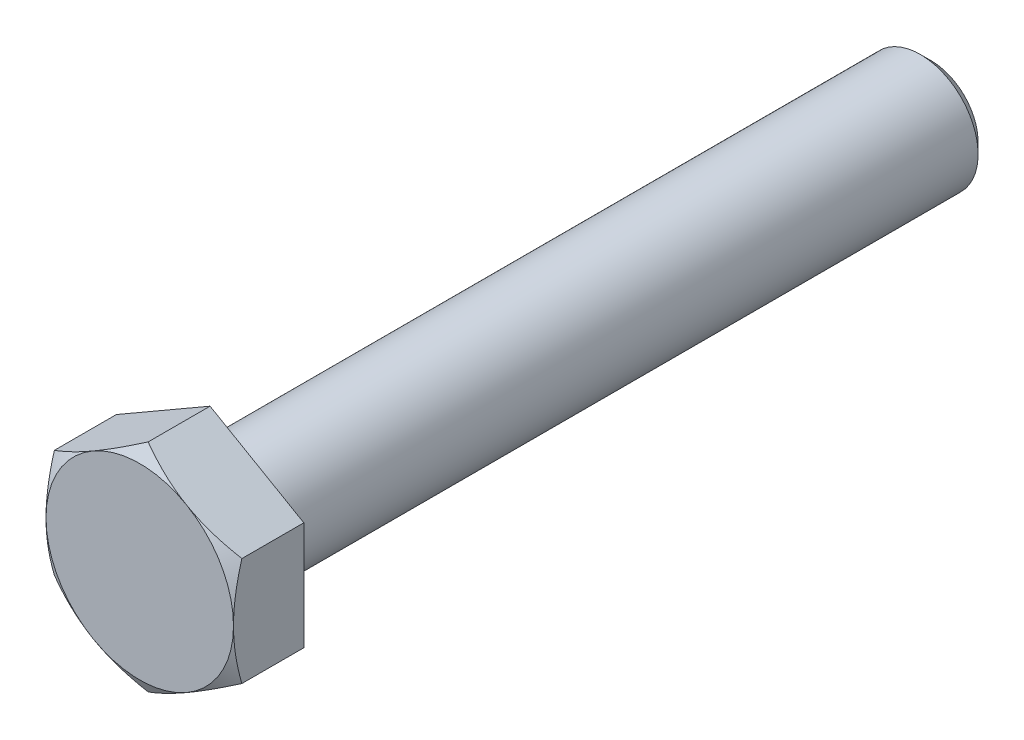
ISO-10303-21;
HEADER;
FILE_DESCRIPTION(('STEP AP214'),'2;1');
FILE_NAME('part.step','',(''),(''),'','','');
FILE_SCHEMA(('AUTOMOTIVE_DESIGN { 1 0 10303 214 1 1 1 1 }'));
ENDSEC;
DATA;
#1=APPLICATION_CONTEXT('core data for automotive mechanical design processes');
#2=APPLICATION_PROTOCOL_DEFINITION('international standard','automotive_design',2000,#1);
#3=PRODUCT_CONTEXT('',#1,'mechanical');
#4=PRODUCT('Part','Part','',(#3));
#5=PRODUCT_RELATED_PRODUCT_CATEGORY('part','',(#4));
#6=PRODUCT_DEFINITION_FORMATION('','',#4);
#7=PRODUCT_DEFINITION_CONTEXT('part definition',#1,'design');
#8=PRODUCT_DEFINITION('design','',#6,#7);
#9=PRODUCT_DEFINITION_SHAPE('','',#8);
#10=(LENGTH_UNIT() NAMED_UNIT(*) SI_UNIT(.MILLI.,.METRE.));
#11=(NAMED_UNIT(*) PLANE_ANGLE_UNIT() SI_UNIT($,.RADIAN.));
#12=(NAMED_UNIT(*) SI_UNIT($,.STERADIAN.) SOLID_ANGLE_UNIT());
#13=UNCERTAINTY_MEASURE_WITH_UNIT(LENGTH_MEASURE(1.E-05),#10,'distance_accuracy_value','');
#14=(GEOMETRIC_REPRESENTATION_CONTEXT(3) GLOBAL_UNCERTAINTY_ASSIGNED_CONTEXT((#13)) GLOBAL_UNIT_ASSIGNED_CONTEXT((#10,
#11,#12)) REPRESENTATION_CONTEXT('',''));
#15=CARTESIAN_POINT('',(0.,0.,0.));
#16=DIRECTION('',(0.,0.,1.));
#17=DIRECTION('',(1.,0.,0.));
#18=AXIS2_PLACEMENT_3D('',#15,#16,#17);
#19=CARTESIAN_POINT('',(0.,-23.8301323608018,8.5873335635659));
#20=DIRECTION('',(0.5,-0.866025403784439,0.));
#21=DIRECTION('',(0.866025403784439,0.5,0.));
#22=AXIS2_PLACEMENT_3D('',#19,#20,#21);
#23=PLANE('',#22);
#24=DIRECTION('',(0.,0.,1.));
#25=VECTOR('',#24,1.);
#26=CARTESIAN_POINT('',(20.6375,-11.9150661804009,8.5873335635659));
#27=LINE('',#26,#25);
#28=CARTESIAN_POINT('',(20.6375,-11.9150661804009,71.6359375));
#29=VERTEX_POINT('',#28);
#30=CARTESIAN_POINT('',(20.6375,-11.9150661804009,85.2707953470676));
#31=VERTEX_POINT('',#30);
#32=EDGE_CURVE('E159',#29,#31,#27,.T.);
#33=ORIENTED_EDGE('',*,*,#32,.T.);
#34=CARTESIAN_POINT('',(20.6377,-11.9149507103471,85.2707286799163));
#35=CARTESIAN_POINT('',(20.1840964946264,-12.1768388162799,85.4219191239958));
#36=CARTESIAN_POINT('',(19.7287236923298,-12.4397484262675,85.5662487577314));
#37=CARTESIAN_POINT('',(18.814326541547,-12.9676758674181,85.8392793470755));
#38=CARTESIAN_POINT('',(18.3553010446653,-13.2326943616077,85.9679751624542));
#39=CARTESIAN_POINT('',(17.4327113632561,-13.7653517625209,86.2080081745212));
#40=CARTESIAN_POINT('',(16.9691391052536,-14.0329953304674,86.3193042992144));
#41=CARTESIAN_POINT('',(16.0387734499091,-14.5701421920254,86.5221480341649));
#42=CARTESIAN_POINT('',(15.571980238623,-14.8396453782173,86.613696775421));
#43=CARTESIAN_POINT('',(14.6471334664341,-15.3736059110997,86.7731519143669));
#44=CARTESIAN_POINT('',(14.1891485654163,-15.6380236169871,86.8415860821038));
#45=CARTESIAN_POINT('',(13.27108023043,-16.1680706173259,86.9563346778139));
#46=CARTESIAN_POINT('',(12.8109967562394,-16.4336999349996,87.0026486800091));
#47=CARTESIAN_POINT('',(11.890056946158,-16.9654047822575,87.0719875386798));
#48=CARTESIAN_POINT('',(11.4292021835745,-17.2314794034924,87.0950400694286));
#49=CARTESIAN_POINT('',(10.5070673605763,-17.7638741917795,87.1173602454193));
#50=CARTESIAN_POINT('',(10.045787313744,-18.03019435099,87.1166286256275));
#51=CARTESIAN_POINT('',(9.18341530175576,-18.528085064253,87.0930416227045));
#52=CARTESIAN_POINT('',(8.78226192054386,-18.759691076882,87.0730624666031));
#53=CARTESIAN_POINT('',(7.98091285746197,-19.2223501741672,87.0154953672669));
#54=CARTESIAN_POINT('',(7.58071716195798,-19.453403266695,86.9779076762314));
#55=CARTESIAN_POINT('',(6.78143133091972,-19.9148711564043,86.8857749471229));
#56=CARTESIAN_POINT('',(6.38234252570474,-20.1452851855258,86.8312145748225));
#57=CARTESIAN_POINT('',(5.5860758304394,-20.605009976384,86.7061021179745));
#58=CARTESIAN_POINT('',(5.18889793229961,-20.8343207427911,86.6355501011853));
#59=CARTESIAN_POINT('',(3.98315033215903,-21.530459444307,86.3980959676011));
#60=CARTESIAN_POINT('',(3.17800639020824,-21.9953095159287,86.2075040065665));
#61=CARTESIAN_POINT('',(1.97918213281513,-22.6874510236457,85.8830300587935));
#62=CARTESIAN_POINT('',(1.58139951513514,-22.9171109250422,85.7685578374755));
#63=CARTESIAN_POINT('',(0.788585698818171,-23.37484219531,85.5280244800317));
#64=CARTESIAN_POINT('',(0.393553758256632,-23.6029139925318,85.4019666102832));
#65=CARTESIAN_POINT('',(-0.000199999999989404,-23.8302478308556,85.2707286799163));
#66=B_SPLINE_CURVE_WITH_KNOTS('',3,(#34,#35,#36,#37,#38,#39,#40,#41,#42,#43,#44,#45,#46,#47,#48,
#49,#50,#51,#52,#53,#54,#55,#56,#57,#58,#59,#60,#61,#62,#63,#64,#65),.UNSPECIFIED.,.F.,.F.,(4,2,
2,2,2,2,2,2,2,2,2,2,2,2,2,4),(0.,1.63552456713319,3.2715854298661,4.91145173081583,
6.55122408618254,8.1505234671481,9.74985363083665,11.3472788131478,12.9446546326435,
14.3352468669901,15.7258191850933,17.1176515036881,18.5094779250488,21.3544387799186,
22.7744411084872,24.1940443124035),.UNSPECIFIED.);
#67=CARTESIAN_POINT('',(10.31875,-17.8725992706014,87.1140625));
#68=VERTEX_POINT('',#67);
#69=EDGE_CURVE('E278',#31,#68,#66,.T.);
#70=ORIENTED_EDGE('',*,*,#69,.T.);
#71=CARTESIAN_POINT('',(0.,-23.8301323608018,85.2707953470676));
#72=VERTEX_POINT('',#71);
#73=EDGE_CURVE('E202',#68,#72,#66,.T.);
#74=ORIENTED_EDGE('',*,*,#73,.T.);
#75=DIRECTION('',(0.,0.,1.));
#76=VECTOR('',#75,1.);
#77=CARTESIAN_POINT('',(0.,-23.8301323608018,8.5873335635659));
#78=LINE('',#77,#76);
#79=CARTESIAN_POINT('',(0.,-23.8301323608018,71.6359375));
#80=VERTEX_POINT('',#79);
#81=EDGE_CURVE('E302',#80,#72,#78,.T.);
#82=ORIENTED_EDGE('',*,*,#81,.F.);
#83=DIRECTION('',(0.866025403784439,0.5,0.));
#84=VECTOR('',#83,1.);
#85=CARTESIAN_POINT('',(0.,-23.8301323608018,71.6359375));
#86=LINE('',#85,#84);
#87=EDGE_CURVE('E157',#80,#29,#86,.T.);
#88=ORIENTED_EDGE('',*,*,#87,.T.);
#89=EDGE_LOOP('',(#33,#70,#74,#82,#88));
#90=FACE_BOUND('',#89,.T.);
#91=ADVANCED_FACE('F46',(#90),#23,.T.);
#92=CARTESIAN_POINT('',(20.6375,-11.9150661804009,8.5873335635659));
#93=DIRECTION('',(1.,0.,0.));
#94=DIRECTION('',(0.,0.,-1.));
#95=AXIS2_PLACEMENT_3D('',#92,#93,#94);
#96=PLANE('',#95);
#97=DIRECTION('',(0.,0.,1.));
#98=VECTOR('',#97,1.);
#99=CARTESIAN_POINT('',(20.6375,11.9150661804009,8.5873335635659));
#100=LINE('',#99,#98);
#101=CARTESIAN_POINT('',(20.6375,11.9150661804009,71.6359375));
#102=VERTEX_POINT('',#101);
#103=CARTESIAN_POINT('',(20.6375,11.9150661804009,85.2707953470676));
#104=VERTEX_POINT('',#103);
#105=EDGE_CURVE('E316',#102,#104,#100,.T.);
#106=ORIENTED_EDGE('',*,*,#105,.T.);
#107=CARTESIAN_POINT('',(20.6375,-32.4256154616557,76.838087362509));
#108=CARTESIAN_POINT('',(20.6375,-31.9730806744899,77.0584981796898));
#109=CARTESIAN_POINT('',(20.6375,-31.5200260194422,77.2778411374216));
#110=CARTESIAN_POINT('',(20.6375,-30.612768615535,77.7141502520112));
#111=CARTESIAN_POINT('',(20.6375,-30.1585658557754,77.9311163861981));
#112=CARTESIAN_POINT('',(20.6375,-28.7939575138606,78.5781424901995));
#113=CARTESIAN_POINT('',(20.6375,-27.8816794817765,79.0042678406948));
#114=CARTESIAN_POINT('',(20.6375,-26.0463911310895,79.845731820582));
#115=CARTESIAN_POINT('',(20.6375,-25.123349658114,80.2610026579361));
#116=CARTESIAN_POINT('',(20.6375,-23.2700704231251,81.0751054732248));
#117=CARTESIAN_POINT('',(20.6375,-22.3398329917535,81.4739382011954));
#118=CARTESIAN_POINT('',(20.6375,-20.439323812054,82.2638617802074));
#119=CARTESIAN_POINT('',(20.6375,-19.4687560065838,82.6542439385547));
#120=CARTESIAN_POINT('',(20.6375,-17.5164156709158,83.4064689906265));
#121=CARTESIAN_POINT('',(20.6375,-16.5346419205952,83.7683087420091));
#122=CARTESIAN_POINT('',(20.6375,-14.5600631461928,84.454252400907));
#123=CARTESIAN_POINT('',(20.6375,-13.5672836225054,84.7784291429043));
#124=CARTESIAN_POINT('',(20.6375,-11.5673985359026,85.3789448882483));
#125=CARTESIAN_POINT('',(20.6375,-10.560297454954,85.6552985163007));
#126=CARTESIAN_POINT('',(20.6375,-9.04144034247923,86.0234282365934));
#127=CARTESIAN_POINT('',(20.6375,-8.53521428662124,86.1381479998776));
#128=CARTESIAN_POINT('',(20.6375,-7.51922760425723,86.3507870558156));
#129=CARTESIAN_POINT('',(20.6375,-7.00946704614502,86.4487066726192));
#130=CARTESIAN_POINT('',(20.6375,-5.98674447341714,86.6260418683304));
#131=CARTESIAN_POINT('',(20.6375,-5.47378260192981,86.7054582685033));
#132=CARTESIAN_POINT('',(20.6375,-4.44513343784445,86.8442256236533));
#133=CARTESIAN_POINT('',(20.6375,-3.92944614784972,86.9035765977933));
#134=CARTESIAN_POINT('',(20.6375,-2.90301545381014,87.0002601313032));
#135=CARTESIAN_POINT('',(20.6375,-2.39229917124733,87.0378788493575));
#136=CARTESIAN_POINT('',(20.6375,-1.36973286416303,87.091466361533));
#137=CARTESIAN_POINT('',(20.6375,-0.857882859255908,87.1074355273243));
#138=CARTESIAN_POINT('',(20.6375,0.166038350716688,87.1173420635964));
#139=CARTESIAN_POINT('',(20.6375,0.678109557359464,87.1112792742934));
#140=CARTESIAN_POINT('',(20.6375,1.70153150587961,87.0772740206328));
#141=CARTESIAN_POINT('',(20.6375,2.21288221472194,87.0493305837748));
#142=CARTESIAN_POINT('',(20.6375,3.42907871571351,86.9574526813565));
#143=CARTESIAN_POINT('',(20.6375,4.13320752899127,86.8838462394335));
#144=CARTESIAN_POINT('',(20.6375,5.53651886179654,86.6990545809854));
#145=CARTESIAN_POINT('',(20.6375,6.23570074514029,86.5878646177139));
#146=CARTESIAN_POINT('',(20.6375,7.6283451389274,86.331860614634));
#147=CARTESIAN_POINT('',(20.6375,8.32180314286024,86.1870222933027));
#148=CARTESIAN_POINT('',(20.6375,9.70190431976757,85.8681605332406));
#149=CARTESIAN_POINT('',(20.6375,10.3885475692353,85.6941374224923));
#150=CARTESIAN_POINT('',(20.6375,11.7709004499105,85.3168368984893));
#151=CARTESIAN_POINT('',(20.6375,12.4664487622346,85.1129725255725));
#152=CARTESIAN_POINT('',(20.6375,13.8506972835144,84.6833091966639));
#153=CARTESIAN_POINT('',(20.6375,14.5393974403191,84.4575100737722));
#154=CARTESIAN_POINT('',(20.6375,15.9102893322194,83.9876361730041));
#155=CARTESIAN_POINT('',(20.6375,16.5924828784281,83.7435666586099));
#156=CARTESIAN_POINT('',(20.6375,17.611479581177,83.3659775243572));
#157=CARTESIAN_POINT('',(20.6375,17.9504279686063,83.2382009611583));
#158=CARTESIAN_POINT('',(20.6375,18.6269817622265,82.9791365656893));
#159=CARTESIAN_POINT('',(20.6375,18.9645871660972,82.8478487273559));
#160=CARTESIAN_POINT('',(20.6375,19.8670735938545,82.4919349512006));
#161=CARTESIAN_POINT('',(20.6375,20.4308061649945,82.2643948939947));
#162=CARTESIAN_POINT('',(20.6375,21.5550661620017,81.8015147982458));
#163=CARTESIAN_POINT('',(20.6375,22.1155935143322,81.5661745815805));
#164=CARTESIAN_POINT('',(20.6375,23.233806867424,81.0887225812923));
#165=CARTESIAN_POINT('',(20.6375,23.7914926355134,80.8466102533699));
#166=CARTESIAN_POINT('',(20.6375,24.9042782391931,80.3565084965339));
#167=CARTESIAN_POINT('',(20.6375,25.4593780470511,80.1085190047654));
#168=CARTESIAN_POINT('',(20.6375,27.1216033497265,79.3567109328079));
#169=CARTESIAN_POINT('',(20.6375,28.2252618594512,78.8452217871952));
#170=CARTESIAN_POINT('',(20.6375,30.4250858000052,77.8065590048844));
#171=CARTESIAN_POINT('',(20.6375,31.5212515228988,77.2793859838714));
#172=CARTESIAN_POINT('',(20.6375,33.709278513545,76.2118893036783));
#173=CARTESIAN_POINT('',(20.6375,34.801130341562,75.6715463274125));
#174=CARTESIAN_POINT('',(20.6375,36.9799230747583,74.5810445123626));
#175=CARTESIAN_POINT('',(20.6375,38.0668639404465,74.0308855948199));
#176=CARTESIAN_POINT('',(20.6375,40.2364746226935,72.9227781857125));
#177=CARTESIAN_POINT('',(20.6375,41.3191452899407,72.3648313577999));
#178=CARTESIAN_POINT('',(20.6375,43.4811328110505,71.242491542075));
#179=CARTESIAN_POINT('',(20.6375,44.5604496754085,70.6780985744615));
#180=CARTESIAN_POINT('',(20.6375,46.6038665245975,69.6031275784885));
#181=CARTESIAN_POINT('',(20.6375,47.5682435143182,69.0930756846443));
#182=CARTESIAN_POINT('',(20.6375,49.4950666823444,68.0693366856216));
#183=CARTESIAN_POINT('',(20.6375,50.4575128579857,67.5556495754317));
#184=CARTESIAN_POINT('',(20.6375,53.3424750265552,66.009887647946));
#185=CARTESIAN_POINT('',(20.6375,55.2625043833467,64.9731704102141));
#186=CARTESIAN_POINT('',(20.6375,58.1356204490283,63.4128746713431));
#187=CARTESIAN_POINT('',(20.6375,59.0905984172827,62.8927700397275));
#188=CARTESIAN_POINT('',(20.6375,60.9994506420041,61.8505377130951));
#189=CARTESIAN_POINT('',(20.6375,61.9533248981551,61.3284100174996));
#190=CARTESIAN_POINT('',(20.6375,63.8600285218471,60.2824241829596));
#191=CARTESIAN_POINT('',(20.6375,64.8128579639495,59.7585661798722));
#192=CARTESIAN_POINT('',(20.6375,66.7176507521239,58.7092806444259));
#193=CARTESIAN_POINT('',(20.6375,67.6696140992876,58.1838531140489));
#194=CARTESIAN_POINT('',(20.6375,68.6211983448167,57.6577405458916));
#195=B_SPLINE_CURVE_WITH_KNOTS('',3,(#107,#108,#109,#110,#111,#112,#113,#114,#115,#116,#117,
#118,#119,#120,#121,#122,#123,#124,#125,#126,#127,#128,#129,#130,#131,#132,#133,#134,#135,#136,
#137,#138,#139,#140,#141,#142,#143,#144,#145,#146,#147,#148,#149,#150,#151,#152,#153,#154,#155,
#156,#157,#158,#159,#160,#161,#162,#163,#164,#165,#166,#167,#168,#169,#170,#171,#172,#173,#174,
#175,#176,#177,#178,#179,#180,#181,#182,#183,#184,#185,#186,#187,#188,#189,#190,#191,#192,#193,
#194),.UNSPECIFIED.,.F.,.F.,(4,2,2,2,2,2,2,2,2,2,2,2,2,2,2,2,2,2,2,2,2,2,2,2,2,2,2,2,2,2,2,2,2,
2,2,2,2,2,2,2,2,2,2,4),(0.,1.51006956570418,3.02015352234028,6.0407474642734,9.07708394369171,
12.1132817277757,15.2513462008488,18.3897556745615,21.5219911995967,24.6532671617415,
26.2102197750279,27.7671423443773,29.3239957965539,30.8808477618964,32.4167030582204,
33.9525319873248,35.4883720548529,37.024280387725,39.1470128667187,41.2700135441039,
43.3945510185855,45.5190646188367,47.6930602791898,49.867072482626,52.0404607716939,
53.1271447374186,54.2138305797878,56.0375227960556,57.8612566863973,59.6851375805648,
61.5090379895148,65.1581216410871,68.807062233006,72.4617221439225,76.116411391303,
79.7703315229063,83.4242402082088,86.6970868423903,89.9699379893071,96.5160143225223,
99.778286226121,103.040559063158,106.302581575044,109.564599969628),.UNSPECIFIED.);
#196=CARTESIAN_POINT('',(20.6375,0.,87.1140625));
#197=VERTEX_POINT('',#196);
#198=EDGE_CURVE('E121',#104,#197,#195,.F.);
#199=ORIENTED_EDGE('',*,*,#198,.T.);
#200=EDGE_CURVE('E166',#197,#31,#195,.F.);
#201=ORIENTED_EDGE('',*,*,#200,.T.);
#202=ORIENTED_EDGE('',*,*,#32,.F.);
#203=DIRECTION('',(0.,1.,0.));
#204=VECTOR('',#203,1.);
#205=CARTESIAN_POINT('',(20.6375,-11.9150661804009,71.6359375));
#206=LINE('',#205,#204);
#207=EDGE_CURVE('E308',#29,#102,#206,.T.);
#208=ORIENTED_EDGE('',*,*,#207,.T.);
#209=EDGE_LOOP('',(#106,#199,#201,#202,#208));
#210=FACE_BOUND('',#209,.T.);
#211=ADVANCED_FACE('F232',(#210),#96,.T.);
#212=CARTESIAN_POINT('',(20.6375,11.9150661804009,8.5873335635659));
#213=DIRECTION('',(0.5,0.866025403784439,0.));
#214=DIRECTION('',(-0.866025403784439,0.5,0.));
#215=AXIS2_PLACEMENT_3D('',#212,#213,#214);
#216=PLANE('',#215);
#217=DIRECTION('',(0.,0.,1.));
#218=VECTOR('',#217,1.);
#219=CARTESIAN_POINT('',(0.,23.8301323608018,8.5873335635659));
#220=LINE('',#219,#218);
#221=CARTESIAN_POINT('',(0.,23.8301323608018,71.6359375));
#222=VERTEX_POINT('',#221);
#223=CARTESIAN_POINT('',(0.,23.8301323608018,85.2707953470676));
#224=VERTEX_POINT('',#223);
#225=EDGE_CURVE('E153',#222,#224,#220,.T.);
#226=ORIENTED_EDGE('',*,*,#225,.T.);
#227=CARTESIAN_POINT('',(-0.000199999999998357,23.8302478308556,85.2707286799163));
#228=CARTESIAN_POINT('',(0.453403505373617,23.5683597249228,85.4219191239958));
#229=CARTESIAN_POINT('',(0.908776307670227,23.3054501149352,85.5662487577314));
#230=CARTESIAN_POINT('',(1.82317345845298,22.7775226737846,85.8392793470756));
#231=CARTESIAN_POINT('',(2.28219895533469,22.512504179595,85.9679751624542));
#232=CARTESIAN_POINT('',(3.20478863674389,21.9798467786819,86.2080081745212));
#233=CARTESIAN_POINT('',(3.66836089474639,21.7122032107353,86.3193042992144));
#234=CARTESIAN_POINT('',(4.59872655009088,21.1750563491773,86.5221480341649));
#235=CARTESIAN_POINT('',(5.06551976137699,20.9055531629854,86.613696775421));
#236=CARTESIAN_POINT('',(5.99036653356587,20.371592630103,86.7731519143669));
#237=CARTESIAN_POINT('',(6.44835143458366,20.1071749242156,86.8415860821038));
#238=CARTESIAN_POINT('',(7.36641976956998,19.5771279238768,86.9563346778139));
#239=CARTESIAN_POINT('',(7.82650324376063,19.3114986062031,87.0026486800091));
#240=CARTESIAN_POINT('',(8.74744305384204,18.7797937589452,87.0719875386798));
#241=CARTESIAN_POINT('',(9.20829781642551,18.5137191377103,87.0950400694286));
#242=CARTESIAN_POINT('',(10.1304326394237,17.9813243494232,87.1173602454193));
#243=CARTESIAN_POINT('',(10.591712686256,17.7150041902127,87.1166286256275));
#244=CARTESIAN_POINT('',(11.4540846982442,17.2171134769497,87.0930416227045));
#245=CARTESIAN_POINT('',(11.8552380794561,16.9855074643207,87.0730624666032));
#246=CARTESIAN_POINT('',(12.656587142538,16.5228483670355,87.0154953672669));
#247=CARTESIAN_POINT('',(13.056782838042,16.2917952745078,86.9779076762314));
#248=CARTESIAN_POINT('',(13.8560686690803,15.8303273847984,86.8857749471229));
#249=CARTESIAN_POINT('',(14.2551574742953,15.5999133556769,86.8312145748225));
#250=CARTESIAN_POINT('',(15.0514241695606,15.1401885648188,86.7061021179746));
#251=CARTESIAN_POINT('',(15.4486020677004,14.9108777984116,86.6355501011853));
#252=CARTESIAN_POINT('',(16.654349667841,14.2147390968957,86.3980959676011));
#253=CARTESIAN_POINT('',(17.4594936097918,13.749889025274,86.2075040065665));
#254=CARTESIAN_POINT('',(18.6583178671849,13.057747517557,85.8830300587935));
#255=CARTESIAN_POINT('',(19.0561004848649,12.8280876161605,85.7685578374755));
#256=CARTESIAN_POINT('',(19.8489143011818,12.3703563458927,85.5280244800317));
#257=CARTESIAN_POINT('',(20.2439462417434,12.1422845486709,85.4019666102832));
#258=CARTESIAN_POINT('',(20.6377,11.9149507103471,85.2707286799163));
#259=B_SPLINE_CURVE_WITH_KNOTS('',3,(#227,#228,#229,#230,#231,#232,#233,#234,#235,#236,#237,
#238,#239,#240,#241,#242,#243,#244,#245,#246,#247,#248,#249,#250,#251,#252,#253,#254,#255,#256,
#257,#258),.UNSPECIFIED.,.F.,.F.,(4,2,2,2,2,2,2,2,2,2,2,2,2,2,2,4),(0.,1.63552456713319,
3.27158542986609,4.91145173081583,6.55122408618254,8.1505234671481,9.74985363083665,
11.3472788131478,12.9446546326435,14.3352468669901,15.7258191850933,17.1176515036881,
18.5094779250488,21.3544387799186,22.7744411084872,24.1940443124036),.UNSPECIFIED.);
#260=CARTESIAN_POINT('',(10.31875,17.8725992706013,87.1140625));
#261=VERTEX_POINT('',#260);
#262=EDGE_CURVE('E130',#224,#261,#259,.T.);
#263=ORIENTED_EDGE('',*,*,#262,.T.);
#264=EDGE_CURVE('E120',#261,#104,#259,.T.);
#265=ORIENTED_EDGE('',*,*,#264,.T.);
#266=ORIENTED_EDGE('',*,*,#105,.F.);
#267=DIRECTION('',(-0.866025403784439,0.5,0.));
#268=VECTOR('',#267,1.);
#269=CARTESIAN_POINT('',(20.6375,11.9150661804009,71.6359375));
#270=LINE('',#269,#268);
#271=EDGE_CURVE('E320',#102,#222,#270,.T.);
#272=ORIENTED_EDGE('',*,*,#271,.T.);
#273=EDGE_LOOP('',(#226,#263,#265,#266,#272));
#274=FACE_BOUND('',#273,.T.);
#275=ADVANCED_FACE('F154',(#274),#216,.T.);
#276=CARTESIAN_POINT('',(0.,23.8301323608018,8.5873335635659));
#277=DIRECTION('',(-0.5,0.866025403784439,0.));
#278=DIRECTION('',(-0.866025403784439,-0.5,0.));
#279=AXIS2_PLACEMENT_3D('',#276,#277,#278);
#280=PLANE('',#279);
#281=DIRECTION('',(0.,0.,1.));
#282=VECTOR('',#281,1.);
#283=CARTESIAN_POINT('',(-20.6375,11.9150661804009,8.5873335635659));
#284=LINE('',#283,#282);
#285=CARTESIAN_POINT('',(-20.6375,11.9150661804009,71.6359375));
#286=VERTEX_POINT('',#285);
#287=CARTESIAN_POINT('',(-20.6375,11.9150661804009,85.2707953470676));
#288=VERTEX_POINT('',#287);
#289=EDGE_CURVE('E307',#286,#288,#284,.T.);
#290=ORIENTED_EDGE('',*,*,#289,.T.);
#291=CARTESIAN_POINT('',(-20.6377,11.9149507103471,85.2707286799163));
#292=CARTESIAN_POINT('',(-20.1840964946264,12.1768388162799,85.4219191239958));
#293=CARTESIAN_POINT('',(-19.7287236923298,12.4397484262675,85.5662487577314));
#294=CARTESIAN_POINT('',(-18.814326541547,12.9676758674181,85.8392793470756));
#295=CARTESIAN_POINT('',(-18.3553010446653,13.2326943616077,85.9679751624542));
#296=CARTESIAN_POINT('',(-17.4327113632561,13.7653517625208,86.2080081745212));
#297=CARTESIAN_POINT('',(-16.9691391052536,14.0329953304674,86.3193042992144));
#298=CARTESIAN_POINT('',(-16.0387734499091,14.5701421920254,86.5221480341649));
#299=CARTESIAN_POINT('',(-15.571980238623,14.8396453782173,86.613696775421));
#300=CARTESIAN_POINT('',(-14.6471334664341,15.3736059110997,86.7731519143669));
#301=CARTESIAN_POINT('',(-14.1891485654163,15.6380236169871,86.8415860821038));
#302=CARTESIAN_POINT('',(-13.27108023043,16.1680706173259,86.9563346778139));
#303=CARTESIAN_POINT('',(-12.8109967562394,16.4336999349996,87.0026486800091));
#304=CARTESIAN_POINT('',(-11.8900569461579,16.9654047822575,87.0719875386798));
#305=CARTESIAN_POINT('',(-11.4292021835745,17.2314794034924,87.0950400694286));
#306=CARTESIAN_POINT('',(-10.5070673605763,17.7638741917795,87.1173602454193));
#307=CARTESIAN_POINT('',(-10.045787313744,18.03019435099,87.1166286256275));
#308=CARTESIAN_POINT('',(-9.18341530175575,18.528085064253,87.0930416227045));
#309=CARTESIAN_POINT('',(-8.78226192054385,18.759691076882,87.0730624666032));
#310=CARTESIAN_POINT('',(-7.98091285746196,19.2223501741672,87.0154953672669));
#311=CARTESIAN_POINT('',(-7.58071716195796,19.453403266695,86.9779076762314));
#312=CARTESIAN_POINT('',(-6.78143133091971,19.9148711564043,86.8857749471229));
#313=CARTESIAN_POINT('',(-6.38234252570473,20.1452851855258,86.8312145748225));
#314=CARTESIAN_POINT('',(-5.58607583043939,20.605009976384,86.7061021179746));
#315=CARTESIAN_POINT('',(-5.18889793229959,20.8343207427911,86.6355501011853));
#316=CARTESIAN_POINT('',(-3.98315033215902,21.530459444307,86.3980959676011));
#317=CARTESIAN_POINT('',(-3.17800639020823,21.9953095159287,86.2075040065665));
#318=CARTESIAN_POINT('',(-1.97918213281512,22.6874510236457,85.8830300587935));
#319=CARTESIAN_POINT('',(-1.58139951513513,22.9171109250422,85.7685578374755));
#320=CARTESIAN_POINT('',(-0.78858569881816,23.37484219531,85.5280244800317));
#321=CARTESIAN_POINT('',(-0.39355375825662,23.6029139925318,85.4019666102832));
#322=CARTESIAN_POINT('',(0.00020000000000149,23.8302478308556,85.2707286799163));
#323=B_SPLINE_CURVE_WITH_KNOTS('',3,(#291,#292,#293,#294,#295,#296,#297,#298,#299,#300,#301,
#302,#303,#304,#305,#306,#307,#308,#309,#310,#311,#312,#313,#314,#315,#316,#317,#318,#319,#320,
#321,#322),.UNSPECIFIED.,.F.,.F.,(4,2,2,2,2,2,2,2,2,2,2,2,2,2,2,4),(0.,1.63552456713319,
3.27158542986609,4.91145173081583,6.55122408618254,8.15052346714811,9.74985363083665,
11.3472788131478,12.9446546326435,14.3352468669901,15.7258191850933,17.1176515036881,
18.5094779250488,21.3544387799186,22.7744411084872,24.1940443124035),.UNSPECIFIED.);
#324=CARTESIAN_POINT('',(-10.31875,17.8725992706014,87.1140625));
#325=VERTEX_POINT('',#324);
#326=EDGE_CURVE('E206',#288,#325,#323,.T.);
#327=ORIENTED_EDGE('',*,*,#326,.T.);
#328=EDGE_CURVE('E127',#325,#224,#323,.T.);
#329=ORIENTED_EDGE('',*,*,#328,.T.);
#330=ORIENTED_EDGE('',*,*,#225,.F.);
#331=DIRECTION('',(-0.866025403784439,-0.5,0.));
#332=VECTOR('',#331,1.);
#333=CARTESIAN_POINT('',(0.,23.8301323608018,71.6359375));
#334=LINE('',#333,#332);
#335=EDGE_CURVE('E311',#222,#286,#334,.T.);
#336=ORIENTED_EDGE('',*,*,#335,.T.);
#337=EDGE_LOOP('',(#290,#327,#329,#330,#336));
#338=FACE_BOUND('',#337,.T.);
#339=ADVANCED_FACE('F218',(#338),#280,.T.);
#340=CARTESIAN_POINT('',(-20.6375,11.9150661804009,8.5873335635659));
#341=DIRECTION('',(-1.,0.,0.));
#342=DIRECTION('',(0.,-1.,0.));
#343=AXIS2_PLACEMENT_3D('',#340,#341,#342);
#344=PLANE('',#343);
#345=DIRECTION('',(0.,0.,1.));
#346=VECTOR('',#345,1.);
#347=CARTESIAN_POINT('',(-20.6375,-11.9150661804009,8.5873335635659));
#348=LINE('',#347,#346);
#349=CARTESIAN_POINT('',(-20.6375,-11.9150661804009,71.6359375));
#350=VERTEX_POINT('',#349);
#351=CARTESIAN_POINT('',(-20.6375,-11.9150661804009,85.2707953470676));
#352=VERTEX_POINT('',#351);
#353=EDGE_CURVE('E286',#350,#352,#348,.T.);
#354=ORIENTED_EDGE('',*,*,#353,.T.);
#355=CARTESIAN_POINT('',(-20.6375,-32.4256154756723,76.8380873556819));
#356=CARTESIAN_POINT('',(-20.6375,-31.9730806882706,77.0584981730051));
#357=CARTESIAN_POINT('',(-20.6375,-31.5200260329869,77.2778411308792));
#358=CARTESIAN_POINT('',(-20.6375,-30.6127686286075,77.7141502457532));
#359=CARTESIAN_POINT('',(-20.6375,-30.1585658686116,77.9311163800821));
#360=CARTESIAN_POINT('',(-20.6375,-28.7939575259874,78.5781424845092));
#361=CARTESIAN_POINT('',(-20.6375,-27.8816794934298,79.0042678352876));
#362=CARTESIAN_POINT('',(-20.6375,-26.0463911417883,79.8457318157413));
#363=CARTESIAN_POINT('',(-20.6375,-25.123349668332,80.2610026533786));
#364=CARTESIAN_POINT('',(-20.6375,-23.2700704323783,81.075105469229));
#365=CARTESIAN_POINT('',(-20.6375,-22.3398330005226,81.4739381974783));
#366=CARTESIAN_POINT('',(-20.6375,-20.439323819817,82.2638617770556));
#367=CARTESIAN_POINT('',(-20.6375,-19.4687560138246,82.6542439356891));
#368=CARTESIAN_POINT('',(-20.6375,-17.5164156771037,83.4064689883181));
#369=CARTESIAN_POINT('',(-20.6375,-16.5346419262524,83.7683087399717));
#370=CARTESIAN_POINT('',(-20.6375,-14.5600631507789,84.4542523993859));
#371=CARTESIAN_POINT('',(-20.6375,-13.5672836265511,84.7784291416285));
#372=CARTESIAN_POINT('',(-20.6375,-11.5673985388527,85.3789448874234));
#373=CARTESIAN_POINT('',(-20.6375,-10.5602974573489,85.6552985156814));
#374=CARTESIAN_POINT('',(-20.6375,-9.04144034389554,86.0234282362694));
#375=CARTESIAN_POINT('',(-20.6375,-8.53521428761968,86.1381479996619));
#376=CARTESIAN_POINT('',(-20.6375,-7.51922760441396,86.3507870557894));
#377=CARTESIAN_POINT('',(-20.6375,-7.00946704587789,86.4487066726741));
#378=CARTESIAN_POINT('',(-20.6375,-5.9867444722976,86.626041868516));
#379=CARTESIAN_POINT('',(-20.6375,-5.47378260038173,86.7054582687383));
#380=CARTESIAN_POINT('',(-20.6375,-4.4451334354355,86.8442256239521));
#381=CARTESIAN_POINT('',(-20.6375,-3.92944614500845,86.9035765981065));
#382=CARTESIAN_POINT('',(-20.6375,-2.90301545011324,87.0002601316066));
#383=CARTESIAN_POINT('',(-20.6375,-2.39229916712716,87.0378788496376));
#384=CARTESIAN_POINT('',(-20.6375,-1.36973285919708,87.0914663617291));
#385=CARTESIAN_POINT('',(-20.6375,-0.857882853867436,87.1074355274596));
#386=CARTESIAN_POINT('',(-20.6375,0.16603835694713,87.1173420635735));
#387=CARTESIAN_POINT('',(-20.6375,0.678109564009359,87.111279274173));
#388=CARTESIAN_POINT('',(-20.6375,1.70153151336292,87.0772740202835));
#389=CARTESIAN_POINT('',(-20.6375,2.21288222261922,87.0493305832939));
#390=CARTESIAN_POINT('',(-20.6375,3.42907872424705,86.9574526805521));
#391=CARTESIAN_POINT('',(-20.6375,4.1332075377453,86.8838462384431));
#392=CARTESIAN_POINT('',(-20.6375,5.53651887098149,86.6990545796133));
#393=CARTESIAN_POINT('',(-20.6375,6.23570075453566,86.5878646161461));
#394=CARTESIAN_POINT('',(-20.6375,7.62834514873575,86.3318606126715));
#395=CARTESIAN_POINT('',(-20.6375,8.32180315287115,86.1870222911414));
#396=CARTESIAN_POINT('',(-20.6375,9.70190433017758,85.8681605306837));
#397=CARTESIAN_POINT('',(-20.6375,10.3885475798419,85.6941374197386));
#398=CARTESIAN_POINT('',(-20.6375,11.7709004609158,85.3168368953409));
#399=CARTESIAN_POINT('',(-20.6375,12.4664487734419,85.1129725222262));
#400=CARTESIAN_POINT('',(-20.6375,13.8506972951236,84.6833091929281));
#401=CARTESIAN_POINT('',(-20.6375,14.5393974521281,84.4575100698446));
#402=CARTESIAN_POINT('',(-20.6375,15.9102893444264,83.9876361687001));
#403=CARTESIAN_POINT('',(-20.6375,16.5924828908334,83.7435666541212));
#404=CARTESIAN_POINT('',(-20.6375,17.6114795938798,83.3659775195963));
#405=CARTESIAN_POINT('',(-20.6375,17.9504279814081,83.2382009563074));
#406=CARTESIAN_POINT('',(-20.6375,18.6269817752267,82.9791365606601));
#407=CARTESIAN_POINT('',(-20.6375,18.9645871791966,82.8478487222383));
#408=CARTESIAN_POINT('',(-20.6375,19.8670736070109,82.4919349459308));
#409=CARTESIAN_POINT('',(-20.6375,20.4308061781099,82.2643948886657));
#410=CARTESIAN_POINT('',(-20.6375,21.5550661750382,81.8015147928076));
#411=CARTESIAN_POINT('',(-20.6375,22.1155935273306,81.5661745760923));
#412=CARTESIAN_POINT('',(-20.6375,23.2338068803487,81.088722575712));
#413=CARTESIAN_POINT('',(-20.6375,23.7914926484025,80.8466102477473));
#414=CARTESIAN_POINT('',(-20.6375,24.9042782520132,80.3565084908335));
#415=CARTESIAN_POINT('',(-20.6375,25.4593780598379,80.1085189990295));
#416=CARTESIAN_POINT('',(-20.6375,27.1216033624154,79.3567109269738));
#417=CARTESIAN_POINT('',(-20.6375,28.2252618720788,78.8452217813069));
#418=CARTESIAN_POINT('',(-20.6375,30.4250858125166,77.8065589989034));
#419=CARTESIAN_POINT('',(-20.6375,31.5212515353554,77.279385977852));
#420=CARTESIAN_POINT('',(-20.6375,33.7092785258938,76.2118892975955));
#421=CARTESIAN_POINT('',(-20.6375,34.8011303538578,75.6715463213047));
#422=CARTESIAN_POINT('',(-20.6375,36.979923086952,74.5810445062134));
#423=CARTESIAN_POINT('',(-20.6375,38.0668639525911,74.0308855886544));
#424=CARTESIAN_POINT('',(-20.6375,40.2364746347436,72.9227781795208));
#425=CARTESIAN_POINT('',(-20.6375,41.3191453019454,72.3648313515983));
#426=CARTESIAN_POINT('',(-20.6375,43.4811328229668,71.2424915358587));
#427=CARTESIAN_POINT('',(-20.6375,44.5604496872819,70.6780985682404));
#428=CARTESIAN_POINT('',(-20.6375,46.6038665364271,69.603127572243));
#429=CARTESIAN_POINT('',(-20.6375,47.5682435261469,69.0930756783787));
#430=CARTESIAN_POINT('',(-20.6375,49.4950666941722,68.0693366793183));
#431=CARTESIAN_POINT('',(-20.6375,50.4575128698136,67.5556495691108));
#432=CARTESIAN_POINT('',(-20.6375,53.3424750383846,66.0098876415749));
#433=CARTESIAN_POINT('',(-20.6375,55.262504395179,64.9731704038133));
#434=CARTESIAN_POINT('',(-20.6375,58.135620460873,63.4128746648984));
#435=CARTESIAN_POINT('',(-20.6375,59.0905984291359,62.8927700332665));
#436=CARTESIAN_POINT('',(-20.6375,60.9994506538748,61.8505377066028));
#437=CARTESIAN_POINT('',(-20.6375,61.9533249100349,61.3284100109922));
#438=CARTESIAN_POINT('',(-20.6375,63.8600285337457,60.2824241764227));
#439=CARTESIAN_POINT('',(-20.6375,64.8128579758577,59.7585661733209));
#440=CARTESIAN_POINT('',(-20.6375,66.7176507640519,58.7092806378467));
#441=CARTESIAN_POINT('',(-20.6375,67.6696141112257,58.1838531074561));
#442=CARTESIAN_POINT('',(-20.6375,68.621198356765,57.6577405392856));
#443=B_SPLINE_CURVE_WITH_KNOTS('',3,(#355,#356,#357,#358,#359,#360,#361,#362,#363,#364,#365,
#366,#367,#368,#369,#370,#371,#372,#373,#374,#375,#376,#377,#378,#379,#380,#381,#382,#383,#384,
#385,#386,#387,#388,#389,#390,#391,#392,#393,#394,#395,#396,#397,#398,#399,#400,#401,#402,#403,
#404,#405,#406,#407,#408,#409,#410,#411,#412,#413,#414,#415,#416,#417,#418,#419,#420,#421,#422,
#423,#424,#425,#426,#427,#428,#429,#430,#431,#432,#433,#434,#435,#436,#437,#438,#439,#440,#441,
#442),.UNSPECIFIED.,.F.,.F.,(4,2,2,2,2,2,2,2,2,2,2,2,2,2,2,2,2,2,2,2,2,2,2,2,2,2,2,2,2,2,2,2,2,
2,2,2,2,2,2,2,2,2,2,4),(0.,1.51006956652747,3.02015352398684,6.04074746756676,9.07708394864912,
12.113281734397,15.2513462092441,18.3897556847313,21.5219912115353,24.6532671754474,
26.2102197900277,27.7671423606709,29.3239958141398,30.8808477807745,32.4167030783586,
33.952532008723,35.4883720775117,37.0242804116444,39.1470128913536,41.2700135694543,
43.3945510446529,45.519064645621,47.6930603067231,49.8670725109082,52.0404608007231,
53.1271447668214,54.2138306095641,56.0375228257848,57.8612567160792,59.6851376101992,
61.5090380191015,65.1581216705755,68.8070622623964,72.4617221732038,76.116411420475,
79.7703315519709,83.424240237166,86.6970868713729,89.9699380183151,96.5160143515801,
99.7782862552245,103.040559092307,106.302581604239,109.564599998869),.UNSPECIFIED.);
#444=CARTESIAN_POINT('',(-20.6375,0.,87.1140625));
#445=VERTEX_POINT('',#444);
#446=EDGE_CURVE('E67',#352,#445,#443,.T.);
#447=ORIENTED_EDGE('',*,*,#446,.T.);
#448=EDGE_CURVE('E213',#445,#288,#443,.T.);
#449=ORIENTED_EDGE('',*,*,#448,.T.);
#450=ORIENTED_EDGE('',*,*,#289,.F.);
#451=DIRECTION('',(0.,-1.,0.));
#452=VECTOR('',#451,1.);
#453=CARTESIAN_POINT('',(-20.6375,11.9150661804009,71.6359375));
#454=LINE('',#453,#452);
#455=EDGE_CURVE('E304',#286,#350,#454,.T.);
#456=ORIENTED_EDGE('',*,*,#455,.T.);
#457=EDGE_LOOP('',(#354,#447,#449,#450,#456));
#458=FACE_BOUND('',#457,.T.);
#459=ADVANCED_FACE('F219',(#458),#344,.T.);
#460=CARTESIAN_POINT('',(-20.6375,-11.9150661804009,8.5873335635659));
#461=DIRECTION('',(-0.5,-0.866025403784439,0.));
#462=DIRECTION('',(0.866025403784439,-0.5,0.));
#463=AXIS2_PLACEMENT_3D('',#460,#461,#462);
#464=PLANE('',#463);
#465=ORIENTED_EDGE('',*,*,#81,.T.);
#466=CARTESIAN_POINT('',(0.000200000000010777,-23.8302478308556,85.2707286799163));
#467=CARTESIAN_POINT('',(-0.453403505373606,-23.5683597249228,85.4219191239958));
#468=CARTESIAN_POINT('',(-0.908776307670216,-23.3054501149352,85.5662487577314));
#469=CARTESIAN_POINT('',(-1.82317345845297,-22.7775226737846,85.8392793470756));
#470=CARTESIAN_POINT('',(-2.28219895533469,-22.512504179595,85.9679751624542));
#471=CARTESIAN_POINT('',(-3.20478863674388,-21.9798467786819,86.2080081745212));
#472=CARTESIAN_POINT('',(-3.66836089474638,-21.7122032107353,86.3193042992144));
#473=CARTESIAN_POINT('',(-4.59872655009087,-21.1750563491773,86.5221480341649));
#474=CARTESIAN_POINT('',(-5.06551976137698,-20.9055531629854,86.613696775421));
#475=CARTESIAN_POINT('',(-5.99036653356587,-20.371592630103,86.7731519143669));
#476=CARTESIAN_POINT('',(-6.44835143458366,-20.1071749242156,86.8415860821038));
#477=CARTESIAN_POINT('',(-7.36641976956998,-19.5771279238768,86.9563346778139));
#478=CARTESIAN_POINT('',(-7.82650324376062,-19.3114986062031,87.0026486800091));
#479=CARTESIAN_POINT('',(-8.74744305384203,-18.7797937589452,87.0719875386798));
#480=CARTESIAN_POINT('',(-9.2082978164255,-18.5137191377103,87.0950400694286));
#481=CARTESIAN_POINT('',(-10.1304326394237,-17.9813243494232,87.1173602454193));
#482=CARTESIAN_POINT('',(-10.591712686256,-17.7150041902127,87.1166286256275));
#483=CARTESIAN_POINT('',(-11.4540846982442,-17.2171134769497,87.0930416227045));
#484=CARTESIAN_POINT('',(-11.8552380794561,-16.9855074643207,87.0730624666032));
#485=CARTESIAN_POINT('',(-12.656587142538,-16.5228483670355,87.0154953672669));
#486=CARTESIAN_POINT('',(-13.056782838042,-16.2917952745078,86.9779076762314));
#487=CARTESIAN_POINT('',(-13.8560686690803,-15.8303273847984,86.8857749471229));
#488=CARTESIAN_POINT('',(-14.2551574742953,-15.5999133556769,86.8312145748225));
#489=CARTESIAN_POINT('',(-15.0514241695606,-15.1401885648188,86.7061021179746));
#490=CARTESIAN_POINT('',(-15.4486020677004,-14.9108777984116,86.6355501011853));
#491=CARTESIAN_POINT('',(-16.654349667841,-14.2147390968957,86.3980959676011));
#492=CARTESIAN_POINT('',(-17.4594936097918,-13.749889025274,86.2075040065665));
#493=CARTESIAN_POINT('',(-18.6583178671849,-13.057747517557,85.8830300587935));
#494=CARTESIAN_POINT('',(-19.0561004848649,-12.8280876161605,85.7685578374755));
#495=CARTESIAN_POINT('',(-19.8489143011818,-12.3703563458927,85.5280244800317));
#496=CARTESIAN_POINT('',(-20.2439462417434,-12.142284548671,85.4019666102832));
#497=CARTESIAN_POINT('',(-20.6377,-11.9149507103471,85.2707286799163));
#498=B_SPLINE_CURVE_WITH_KNOTS('',3,(#466,#467,#468,#469,#470,#471,#472,#473,#474,#475,#476,
#477,#478,#479,#480,#481,#482,#483,#484,#485,#486,#487,#488,#489,#490,#491,#492,#493,#494,#495,
#496,#497),.UNSPECIFIED.,.F.,.F.,(4,2,2,2,2,2,2,2,2,2,2,2,2,2,2,4),(0.,1.63552456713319,
3.27158542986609,4.91145173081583,6.55122408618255,8.15052346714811,9.74985363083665,
11.3472788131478,12.9446546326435,14.3352468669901,15.7258191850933,17.1176515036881,
18.5094779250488,21.3544387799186,22.7744411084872,24.1940443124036),.UNSPECIFIED.);
#499=CARTESIAN_POINT('',(-10.31875,-17.8725992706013,87.1140625));
#500=VERTEX_POINT('',#499);
#501=EDGE_CURVE('E293',#72,#500,#498,.T.);
#502=ORIENTED_EDGE('',*,*,#501,.T.);
#503=EDGE_CURVE('E146',#500,#352,#498,.T.);
#504=ORIENTED_EDGE('',*,*,#503,.T.);
#505=ORIENTED_EDGE('',*,*,#353,.F.);
#506=DIRECTION('',(0.866025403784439,-0.5,0.));
#507=VECTOR('',#506,1.);
#508=CARTESIAN_POINT('',(-20.6375,-11.9150661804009,71.6359375));
#509=LINE('',#508,#507);
#510=EDGE_CURVE('E296',#350,#80,#509,.T.);
#511=ORIENTED_EDGE('',*,*,#510,.T.);
#512=EDGE_LOOP('',(#465,#502,#504,#505,#511));
#513=FACE_BOUND('',#512,.T.);
#514=ADVANCED_FACE('F185',(#513),#464,.T.);
#515=CARTESIAN_POINT('',(0.,20.6375,71.6359375));
#516=DIRECTION('',(0.,0.,-1.));
#517=DIRECTION('',(-1.,0.,0.));
#518=AXIS2_PLACEMENT_3D('',#515,#516,#517);
#519=PLANE('',#518);
#520=CARTESIAN_POINT('',(0.,0.,71.6359375));
#521=DIRECTION('',(0.,0.,-1.));
#522=DIRECTION('',(-1.,0.,0.));
#523=AXIS2_PLACEMENT_3D('',#520,#521,#522);
#524=CIRCLE('',#523,13.208);
#525=CARTESIAN_POINT('',(-13.208,0.,71.6359375));
#526=VERTEX_POINT('',#525);
#527=EDGE_CURVE('E12',#526,#526,#524,.F.);
#528=ORIENTED_EDGE('',*,*,#527,.T.);
#529=EDGE_LOOP('',(#528));
#530=FACE_BOUND('',#529,.T.);
#531=ORIENTED_EDGE('',*,*,#510,.F.);
#532=ORIENTED_EDGE('',*,*,#455,.F.);
#533=ORIENTED_EDGE('',*,*,#335,.F.);
#534=ORIENTED_EDGE('',*,*,#271,.F.);
#535=ORIENTED_EDGE('',*,*,#207,.F.);
#536=ORIENTED_EDGE('',*,*,#87,.F.);
#537=EDGE_LOOP('',(#531,#532,#533,#534,#535,#536));
#538=FACE_BOUND('',#537,.T.);
#539=ADVANCED_FACE('F226',(#530,#538),#519,.T.);
#540=CARTESIAN_POINT('',(0.,0.,-87.1140625));
#541=DIRECTION('',(0.,0.,-1.));
#542=DIRECTION('',(-1.,0.,0.));
#543=AXIS2_PLACEMENT_3D('',#540,#541,#542);
#544=CYLINDRICAL_SURFACE('',#543,12.7);
#545=CARTESIAN_POINT('',(0.,0.,71.1279375));
#546=DIRECTION('',(0.,0.,-1.));
#547=DIRECTION('',(-1.,0.,0.));
#548=AXIS2_PLACEMENT_3D('',#545,#546,#547);
#549=CIRCLE('',#548,12.7);
#550=CARTESIAN_POINT('',(-12.7,0.,71.1279375));
#551=VERTEX_POINT('',#550);
#552=EDGE_CURVE('E54',#551,#551,#549,.T.);
#553=ORIENTED_EDGE('',*,*,#552,.T.);
#554=EDGE_LOOP('',(#553));
#555=FACE_BOUND('',#554,.T.);
#556=CARTESIAN_POINT('',(0.,0.,-84.7328125));
#557=DIRECTION('',(0.,0.,-1.));
#558=DIRECTION('',(-1.,0.,0.));
#559=AXIS2_PLACEMENT_3D('',#556,#557,#558);
#560=CIRCLE('',#559,12.7);
#561=CARTESIAN_POINT('',(-12.7,0.,-84.7328125));
#562=VERTEX_POINT('',#561);
#563=EDGE_CURVE('E328',#562,#562,#560,.T.);
#564=ORIENTED_EDGE('',*,*,#563,.F.);
#565=EDGE_LOOP('',(#564));
#566=FACE_BOUND('',#565,.T.);
#567=ADVANCED_FACE('F247',(#555,#566),#544,.T.);
#568=CARTESIAN_POINT('',(0.,0.,-87.1140625));
#569=DIRECTION('',(0.,0.,1.));
#570=DIRECTION('',(1.,0.,0.));
#571=AXIS2_PLACEMENT_3D('',#568,#569,#570);
#572=CONICAL_SURFACE('',#571,10.31875,0.785398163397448);
#573=ORIENTED_EDGE('',*,*,#563,.T.);
#574=EDGE_LOOP('',(#573));
#575=FACE_BOUND('',#574,.T.);
#576=CARTESIAN_POINT('',(0.,0.,-87.1140625));
#577=DIRECTION('',(0.,0.,-1.));
#578=DIRECTION('',(-1.,0.,0.));
#579=AXIS2_PLACEMENT_3D('',#576,#577,#578);
#580=CIRCLE('',#579,10.31875);
#581=CARTESIAN_POINT('',(-10.31875,0.,-87.1140625));
#582=VERTEX_POINT('',#581);
#583=EDGE_CURVE('E324',#582,#582,#580,.T.);
#584=ORIENTED_EDGE('',*,*,#583,.F.);
#585=EDGE_LOOP('',(#584));
#586=FACE_BOUND('',#585,.T.);
#587=ADVANCED_FACE('F242',(#575,#586),#572,.T.);
#588=CARTESIAN_POINT('',(0.,10.31875,-87.1140625));
#589=DIRECTION('',(0.,0.,-1.));
#590=DIRECTION('',(-1.,0.,0.));
#591=AXIS2_PLACEMENT_3D('',#588,#589,#590);
#592=PLANE('',#591);
#593=ORIENTED_EDGE('',*,*,#583,.T.);
#594=EDGE_LOOP('',(#593));
#595=FACE_BOUND('',#594,.T.);
#596=ADVANCED_FACE('F245',(#595),#592,.T.);
#597=CARTESIAN_POINT('',(0.,0.,87.1140625));
#598=DIRECTION('',(0.,0.,-1.));
#599=DIRECTION('',(1.,0.,0.));
#600=AXIS2_PLACEMENT_3D('',#597,#598,#599);
#601=CONICAL_SURFACE('',#600,20.6375,1.0471975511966);
#602=CARTESIAN_POINT('',(0.,0.,87.1140625));
#603=DIRECTION('',(0.,0.,1.));
#604=DIRECTION('',(1.,0.,0.));
#605=AXIS2_PLACEMENT_3D('',#602,#603,#604);
#606=CIRCLE('',#605,20.6375);
#607=EDGE_CURVE('E145',#68,#197,#606,.T.);
#608=ORIENTED_EDGE('',*,*,#607,.F.);
#609=ORIENTED_EDGE('',*,*,#69,.F.);
#610=ORIENTED_EDGE('',*,*,#200,.F.);
#611=EDGE_LOOP('',(#608,#609,#610));
#612=FACE_BOUND('',#611,.T.);
#613=ADVANCED_FACE('F244',(#612),#601,.T.);
#614=EDGE_CURVE('E283',#500,#68,#606,.T.);
#615=ORIENTED_EDGE('',*,*,#614,.F.);
#616=ORIENTED_EDGE('',*,*,#501,.F.);
#617=ORIENTED_EDGE('',*,*,#73,.F.);
#618=EDGE_LOOP('',(#615,#616,#617));
#619=FACE_BOUND('',#618,.T.);
#620=ADVANCED_FACE('F181',(#619),#601,.T.);
#621=ORIENTED_EDGE('',*,*,#503,.F.);
#622=EDGE_CURVE('E282',#445,#500,#606,.T.);
#623=ORIENTED_EDGE('',*,*,#622,.F.);
#624=ORIENTED_EDGE('',*,*,#446,.F.);
#625=EDGE_LOOP('',(#621,#623,#624));
#626=FACE_BOUND('',#625,.T.);
#627=ADVANCED_FACE('F180',(#626),#601,.T.);
#628=ORIENTED_EDGE('',*,*,#448,.F.);
#629=EDGE_CURVE('E138',#325,#445,#606,.T.);
#630=ORIENTED_EDGE('',*,*,#629,.F.);
#631=ORIENTED_EDGE('',*,*,#326,.F.);
#632=EDGE_LOOP('',(#628,#630,#631));
#633=FACE_BOUND('',#632,.T.);
#634=ADVANCED_FACE('F182',(#633),#601,.T.);
#635=ORIENTED_EDGE('',*,*,#328,.F.);
#636=EDGE_CURVE('E135',#261,#325,#606,.T.);
#637=ORIENTED_EDGE('',*,*,#636,.F.);
#638=ORIENTED_EDGE('',*,*,#262,.F.);
#639=EDGE_LOOP('',(#635,#637,#638));
#640=FACE_BOUND('',#639,.T.);
#641=ADVANCED_FACE('F134',(#640),#601,.T.);
#642=CARTESIAN_POINT('',(0.,0.,87.1140625));
#643=DIRECTION('',(0.,0.,1.));
#644=DIRECTION('',(1.,0.,0.));
#645=AXIS2_PLACEMENT_3D('',#642,#643,#644);
#646=CIRCLE('',#645,20.6375);
#647=EDGE_CURVE('E65',#197,#261,#646,.T.);
#648=ORIENTED_EDGE('',*,*,#647,.F.);
#649=ORIENTED_EDGE('',*,*,#198,.F.);
#650=ORIENTED_EDGE('',*,*,#264,.F.);
#651=EDGE_LOOP('',(#648,#649,#650));
#652=FACE_BOUND('',#651,.T.);
#653=ADVANCED_FACE('F117',(#652),#601,.T.);
#654=CARTESIAN_POINT('',(0.,0.,87.1140625));
#655=DIRECTION('',(0.,0.,1.));
#656=DIRECTION('',(1.,0.,0.));
#657=AXIS2_PLACEMENT_3D('',#654,#655,#656);
#658=PLANE('',#657);
#659=ORIENTED_EDGE('',*,*,#607,.T.);
#660=ORIENTED_EDGE('',*,*,#647,.T.);
#661=ORIENTED_EDGE('',*,*,#636,.T.);
#662=ORIENTED_EDGE('',*,*,#629,.T.);
#663=ORIENTED_EDGE('',*,*,#622,.T.);
#664=ORIENTED_EDGE('',*,*,#614,.T.);
#665=EDGE_LOOP('',(#659,#660,#661,#662,#663,#664));
#666=FACE_BOUND('',#665,.T.);
#667=ADVANCED_FACE('F144',(#666),#658,.T.);
#668=CARTESIAN_POINT('',(0.,0.,71.1279375));
#669=DIRECTION('',(0.,0.,1.));
#670=DIRECTION('',(1.,0.,0.));
#671=AXIS2_PLACEMENT_3D('',#668,#669,#670);
#672=CONICAL_SURFACE('',#671,12.7,0.785398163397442);
#673=ORIENTED_EDGE('',*,*,#527,.F.);
#674=EDGE_LOOP('',(#673));
#675=FACE_BOUND('',#674,.T.);
#676=ORIENTED_EDGE('',*,*,#552,.F.);
#677=EDGE_LOOP('',(#676));
#678=FACE_BOUND('',#677,.T.);
#679=ADVANCED_FACE('F48',(#675,#678),#672,.T.);
#680=CLOSED_SHELL('',(#91,#211,#275,#339,#459,#514,#539,#567,#587,#596,#613,#620,#627,#634,#641,
#653,#667,#679));
#681=MANIFOLD_SOLID_BREP('B2',#680);
#682=ADVANCED_BREP_SHAPE_REPRESENTATION('',(#18,#681),#14);
#683=SHAPE_DEFINITION_REPRESENTATION(#9,#682);
ENDSEC;
END-ISO-10303-21;
